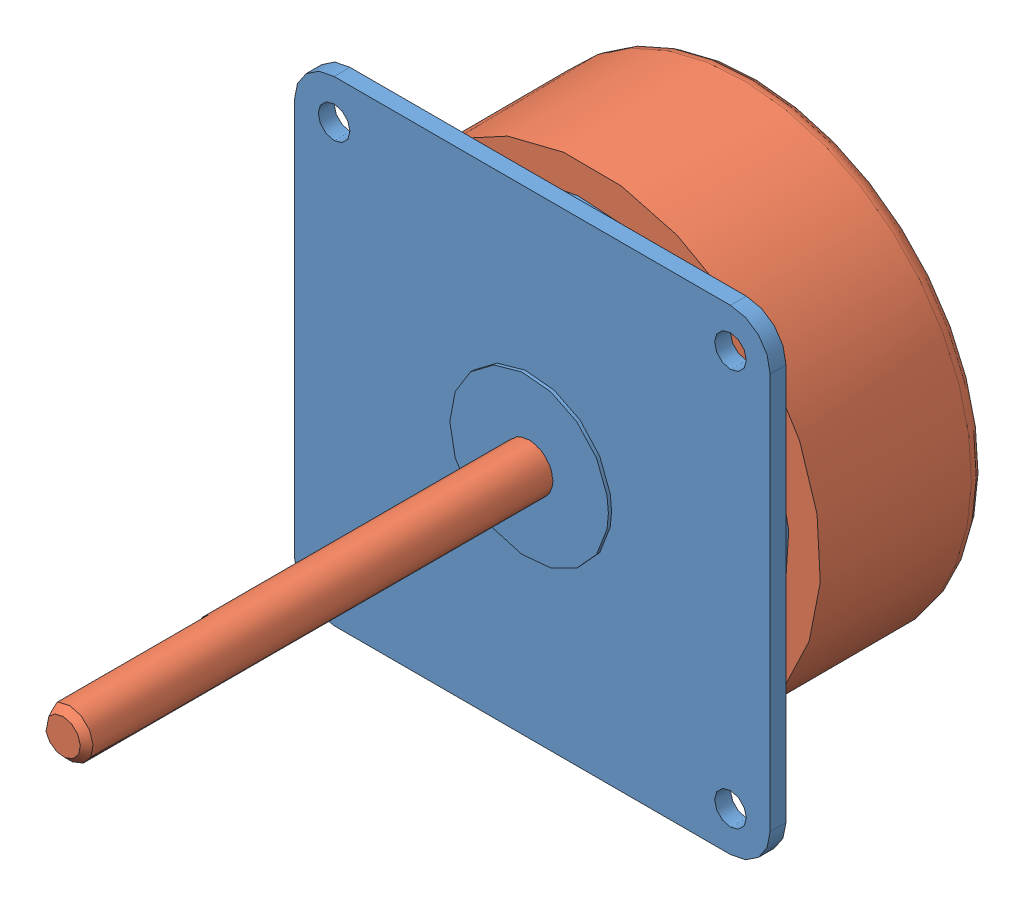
SolidWorks assembly Mini Alternateur.SLDASM, configuration Défaut (file format 4400). Lengths in mm.
Overall size (34.06 34.06 43.8).
2 component instances, 2 part files, 2 mates.
Components (placement in the parent):
- Stator-1: Stator.SLDPRT [Défaut] at (-0.6366 -0.2775 0) size (30 30 13.2)
- Rotor-1: Rotor.SLDPRT [Défaut] at (-0.6366 -0.2775 -14.2) x (0 0 1) z (-0.9811 0.193503 0) size (43.8 29 29)
Mates (geometry in assembly coordinates):
- Coïncidente1: coincident aligned: axis of Stator-1 through (-0.6366 -0.2775 -12) axis (0 0 1); axis of Rotor-1 through (-0.6366 -0.2775 -20.6357) axis (0 0 1)
- Coïncidente2: coincident anti-aligned: plane of Stator-1 through (-0.6366 -0.2775 -12) normal (0 0 -1); plane of Rotor-1 through (0.1374 3.6469 -12) normal (0 0 1)
